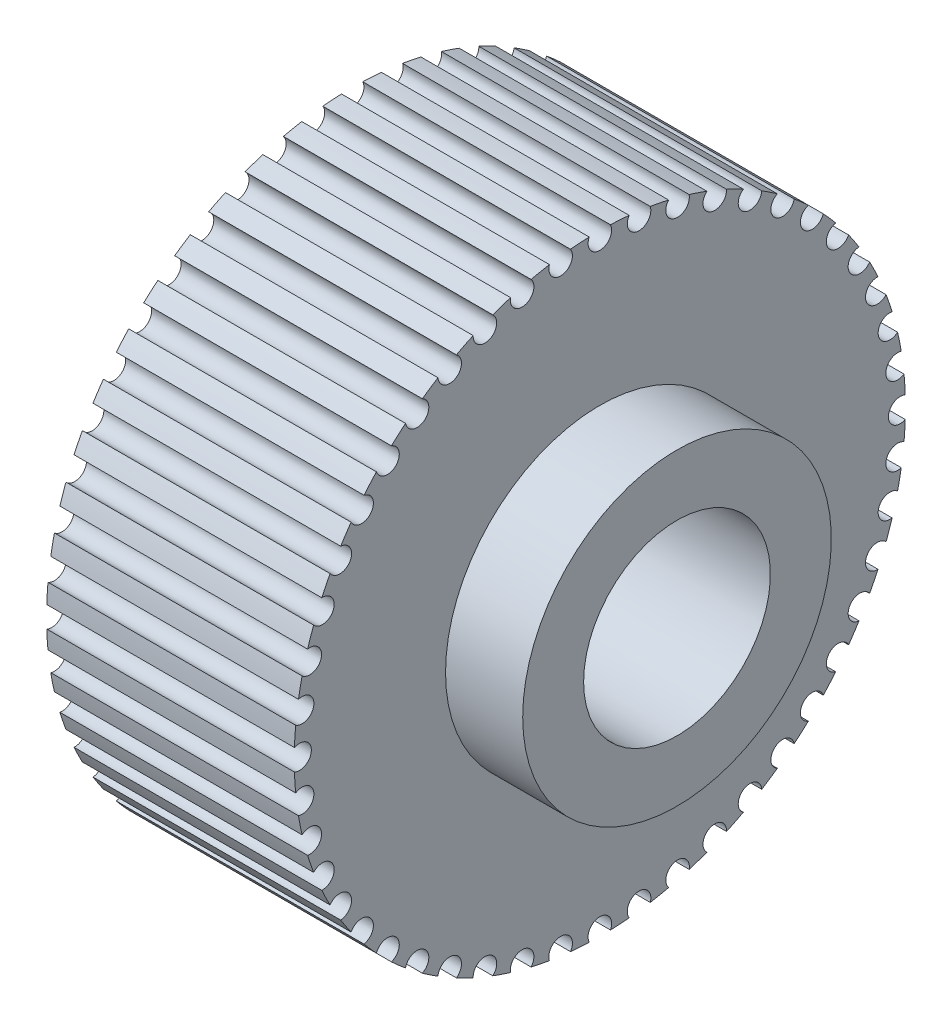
from build123d import *

# Parameters (mm, degrees)
CROQUIS3_R            = 1.45
CORTAR_EXTRUIR1_DEPTH = 67.567869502
MATRIZC1_COUNT        = 48


with BuildPart() as part:
    # Croquis1 → Revoluci_n1 (revolve)
    with BuildSketch(Plane.XY, mode=Mode.PRIVATE) as revoluci_n1_sk:
        Polygon((0, 11.5), (0, 37.625), (30.5, 37.625), (30.5, 19), (40, 19), (40, 11.5), align=None)
    revolve(revoluci_n1_sk.sketch.rotate(Axis((0, 0, 0), (1, 0, 0)), 90), axis=Axis((0, 0, 0), (1, 0, 0)))

    # Croquis3 → Cortar-Extruir1 (cut, through all)
    with BuildSketch(Plane.ZY):
        with Locations((0, 36.975)):
            Circle(CROQUIS3_R)
    cortar_extruir1 = extrude(amount=-CORTAR_EXTRUIR1_DEPTH, mode=Mode.SUBTRACT)

    # MatrizC1: Cortar-Extruir1 ×48 about axis
    matrizc1_axis = Axis((0, 0, 0), (1, 0, 0))
    for i in range(1, MATRIZC1_COUNT):
        add(cortar_extruir1.rotate(matrizc1_axis, i * 360 / MATRIZC1_COUNT), mode=Mode.SUBTRACT)


solid = part.part
